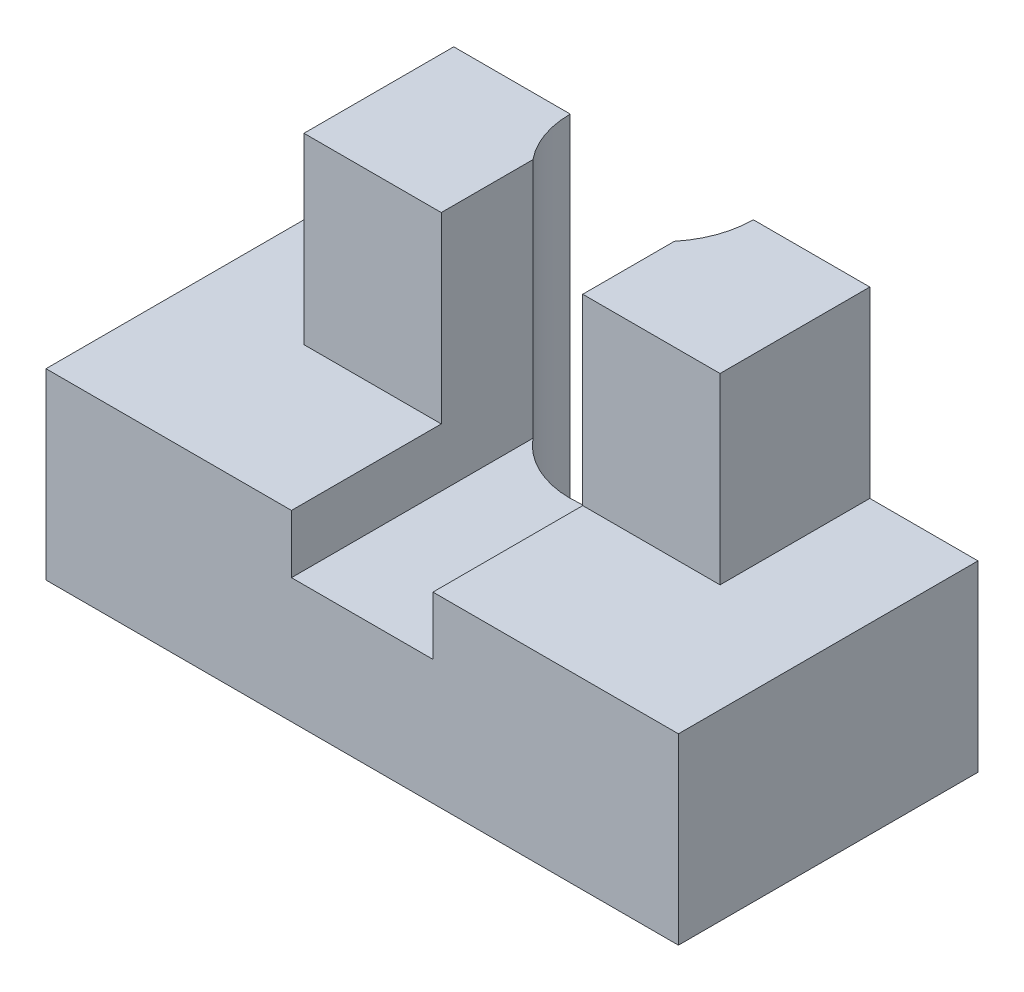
ISO-10303-21;
HEADER;
FILE_DESCRIPTION(('STEP AP214'),'2;1');
FILE_NAME('part.step','',(''),(''),'','','');
FILE_SCHEMA(('AUTOMOTIVE_DESIGN { 1 0 10303 214 1 1 1 1 }'));
ENDSEC;
DATA;
#1=APPLICATION_CONTEXT('core data for automotive mechanical design processes');
#2=APPLICATION_PROTOCOL_DEFINITION('international standard','automotive_design',2000,#1);
#3=PRODUCT_CONTEXT('',#1,'mechanical');
#4=PRODUCT('Part','Part','',(#3));
#5=PRODUCT_RELATED_PRODUCT_CATEGORY('part','',(#4));
#6=PRODUCT_DEFINITION_FORMATION('','',#4);
#7=PRODUCT_DEFINITION_CONTEXT('part definition',#1,'design');
#8=PRODUCT_DEFINITION('design','',#6,#7);
#9=PRODUCT_DEFINITION_SHAPE('','',#8);
#10=(LENGTH_UNIT() NAMED_UNIT(*) SI_UNIT(.MILLI.,.METRE.));
#11=(NAMED_UNIT(*) PLANE_ANGLE_UNIT() SI_UNIT($,.RADIAN.));
#12=(NAMED_UNIT(*) SI_UNIT($,.STERADIAN.) SOLID_ANGLE_UNIT());
#13=UNCERTAINTY_MEASURE_WITH_UNIT(LENGTH_MEASURE(1.E-05),#10,'distance_accuracy_value','');
#14=(GEOMETRIC_REPRESENTATION_CONTEXT(3) GLOBAL_UNCERTAINTY_ASSIGNED_CONTEXT((#13)) GLOBAL_UNIT_ASSIGNED_CONTEXT((#10,
#11,#12)) REPRESENTATION_CONTEXT('',''));
#15=CARTESIAN_POINT('',(0.,0.,0.));
#16=DIRECTION('',(0.,0.,1.));
#17=DIRECTION('',(1.,0.,0.));
#18=AXIS2_PLACEMENT_3D('',#15,#16,#17);
#19=CARTESIAN_POINT('',(-38.,22.,-18.));
#20=DIRECTION('',(0.,0.,1.));
#21=DIRECTION('',(1.,0.,0.));
#22=AXIS2_PLACEMENT_3D('',#19,#20,#21);
#23=PLANE('',#22);
#24=DIRECTION('',(-1.,0.,0.));
#25=VECTOR('',#24,1.);
#26=CARTESIAN_POINT('',(0.,44.,-18.));
#27=LINE('',#26,#25);
#28=CARTESIAN_POINT('',(-11.,44.,-18.));
#29=VERTEX_POINT('',#28);
#30=CARTESIAN_POINT('',(-25.,44.,-18.));
#31=VERTEX_POINT('',#30);
#32=EDGE_CURVE('E223',#29,#31,#27,.T.);
#33=ORIENTED_EDGE('',*,*,#32,.F.);
#34=DIRECTION('',(0.,-1.,0.));
#35=VECTOR('',#34,1.);
#36=CARTESIAN_POINT('',(-11.,0.,-18.));
#37=LINE('',#36,#35);
#38=CARTESIAN_POINT('',(-11.,0.,-18.));
#39=VERTEX_POINT('',#38);
#40=EDGE_CURVE('E222',#29,#39,#37,.T.);
#41=ORIENTED_EDGE('',*,*,#40,.T.);
#42=DIRECTION('',(-1.,0.,0.));
#43=VECTOR('',#42,1.);
#44=CARTESIAN_POINT('',(-38.,0.,-18.));
#45=LINE('',#44,#43);
#46=CARTESIAN_POINT('',(-38.,0.,-18.));
#47=VERTEX_POINT('',#46);
#48=EDGE_CURVE('E161',#39,#47,#45,.T.);
#49=ORIENTED_EDGE('',*,*,#48,.T.);
#50=DIRECTION('',(0.,-1.,0.));
#51=VECTOR('',#50,1.);
#52=CARTESIAN_POINT('',(-38.,22.,-18.));
#53=LINE('',#52,#51);
#54=CARTESIAN_POINT('',(-38.,22.,-18.));
#55=VERTEX_POINT('',#54);
#56=EDGE_CURVE('E177',#55,#47,#53,.T.);
#57=ORIENTED_EDGE('',*,*,#56,.F.);
#58=DIRECTION('',(-1.,0.,0.));
#59=VECTOR('',#58,1.);
#60=CARTESIAN_POINT('',(-38.,22.,-18.));
#61=LINE('',#60,#59);
#62=CARTESIAN_POINT('',(-25.,22.,-18.));
#63=VERTEX_POINT('',#62);
#64=EDGE_CURVE('E191',#63,#55,#61,.T.);
#65=ORIENTED_EDGE('',*,*,#64,.F.);
#66=DIRECTION('',(0.,-1.,0.));
#67=VECTOR('',#66,1.);
#68=CARTESIAN_POINT('',(-25.,44.,-18.));
#69=LINE('',#68,#67);
#70=EDGE_CURVE('E202',#31,#63,#69,.T.);
#71=ORIENTED_EDGE('',*,*,#70,.F.);
#72=EDGE_LOOP('',(#33,#41,#49,#57,#65,#71));
#73=FACE_BOUND('',#72,.T.);
#74=ADVANCED_FACE('F31',(#73),#23,.F.);
#75=CARTESIAN_POINT('',(-38.,22.,18.));
#76=DIRECTION('',(0.,1.,0.));
#77=DIRECTION('',(0.,0.,1.));
#78=AXIS2_PLACEMENT_3D('',#75,#76,#77);
#79=PLANE('',#78);
#80=DIRECTION('',(0.,0.,1.));
#81=VECTOR('',#80,1.);
#82=CARTESIAN_POINT('',(-8.5,22.,18.));
#83=LINE('',#82,#81);
#84=CARTESIAN_POINT('',(-8.5,22.,0.));
#85=VERTEX_POINT('',#84);
#86=CARTESIAN_POINT('',(-8.49999999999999,22.,18.));
#87=VERTEX_POINT('',#86);
#88=EDGE_CURVE('E248',#85,#87,#83,.T.);
#89=ORIENTED_EDGE('',*,*,#88,.F.);
#90=DIRECTION('',(1.,0.,0.));
#91=VECTOR('',#90,1.);
#92=CARTESIAN_POINT('',(0.,22.,0.));
#93=LINE('',#92,#91);
#94=CARTESIAN_POINT('',(-25.,22.,0.));
#95=VERTEX_POINT('',#94);
#96=EDGE_CURVE('E263',#95,#85,#93,.T.);
#97=ORIENTED_EDGE('',*,*,#96,.F.);
#98=DIRECTION('',(0.,0.,1.));
#99=VECTOR('',#98,1.);
#100=CARTESIAN_POINT('',(-25.,22.,-18.));
#101=LINE('',#100,#99);
#102=EDGE_CURVE('E250',#63,#95,#101,.T.);
#103=ORIENTED_EDGE('',*,*,#102,.F.);
#104=ORIENTED_EDGE('',*,*,#64,.T.);
#105=DIRECTION('',(0.,0.,1.));
#106=VECTOR('',#105,1.);
#107=CARTESIAN_POINT('',(-38.,22.,-18.));
#108=LINE('',#107,#106);
#109=CARTESIAN_POINT('',(-38.,22.,18.));
#110=VERTEX_POINT('',#109);
#111=EDGE_CURVE('E168',#55,#110,#108,.T.);
#112=ORIENTED_EDGE('',*,*,#111,.T.);
#113=DIRECTION('',(1.,0.,0.));
#114=VECTOR('',#113,1.);
#115=CARTESIAN_POINT('',(-38.,22.,18.));
#116=LINE('',#115,#114);
#117=EDGE_CURVE('E213',#110,#87,#116,.T.);
#118=ORIENTED_EDGE('',*,*,#117,.T.);
#119=EDGE_LOOP('',(#89,#97,#103,#104,#112,#118));
#120=FACE_BOUND('',#119,.T.);
#121=ADVANCED_FACE('F312',(#120),#79,.T.);
#122=CARTESIAN_POINT('',(0.,44.,0.));
#123=DIRECTION('',(0.,0.,-1.));
#124=DIRECTION('',(-1.,0.,0.));
#125=AXIS2_PLACEMENT_3D('',#122,#123,#124);
#126=PLANE('',#125);
#127=ORIENTED_EDGE('',*,*,#96,.T.);
#128=DIRECTION('',(0.,1.,0.));
#129=VECTOR('',#128,1.);
#130=CARTESIAN_POINT('',(-8.5,44.,0.));
#131=LINE('',#130,#129);
#132=CARTESIAN_POINT('',(-8.5,44.,0.));
#133=VERTEX_POINT('',#132);
#134=EDGE_CURVE('E245',#85,#133,#131,.T.);
#135=ORIENTED_EDGE('',*,*,#134,.T.);
#136=DIRECTION('',(1.,0.,0.));
#137=VECTOR('',#136,1.);
#138=CARTESIAN_POINT('',(0.,44.,0.));
#139=LINE('',#138,#137);
#140=CARTESIAN_POINT('',(-25.,44.,0.));
#141=VERTEX_POINT('',#140);
#142=EDGE_CURVE('E256',#141,#133,#139,.T.);
#143=ORIENTED_EDGE('',*,*,#142,.F.);
#144=DIRECTION('',(0.,-1.,0.));
#145=VECTOR('',#144,1.);
#146=CARTESIAN_POINT('',(-25.,44.,0.));
#147=LINE('',#146,#145);
#148=EDGE_CURVE('E298',#141,#95,#147,.T.);
#149=ORIENTED_EDGE('',*,*,#148,.T.);
#150=EDGE_LOOP('',(#127,#135,#143,#149));
#151=FACE_BOUND('',#150,.T.);
#152=ADVANCED_FACE('F291',(#151),#126,.F.);
#153=CARTESIAN_POINT('',(-25.,44.,-18.));
#154=DIRECTION('',(0.,1.,0.));
#155=DIRECTION('',(0.,0.,1.));
#156=AXIS2_PLACEMENT_3D('',#153,#154,#155);
#157=PLANE('',#156);
#158=CARTESIAN_POINT('',(0.,44.,-18.));
#159=DIRECTION('',(0.,1.,0.));
#160=DIRECTION('',(0.,0.,1.));
#161=AXIS2_PLACEMENT_3D('',#158,#159,#160);
#162=CIRCLE('',#161,11.);
#163=CARTESIAN_POINT('',(-8.49999999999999,44.,-11.0178799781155));
#164=VERTEX_POINT('',#163);
#165=EDGE_CURVE('E226',#29,#164,#162,.T.);
#166=ORIENTED_EDGE('',*,*,#165,.F.);
#167=ORIENTED_EDGE('',*,*,#32,.T.);
#168=DIRECTION('',(0.,0.,1.));
#169=VECTOR('',#168,1.);
#170=CARTESIAN_POINT('',(-25.,44.,-18.));
#171=LINE('',#170,#169);
#172=EDGE_CURVE('E253',#31,#141,#171,.T.);
#173=ORIENTED_EDGE('',*,*,#172,.T.);
#174=ORIENTED_EDGE('',*,*,#142,.T.);
#175=DIRECTION('',(0.,0.,1.));
#176=VECTOR('',#175,1.);
#177=CARTESIAN_POINT('',(-8.5,44.,-18.));
#178=LINE('',#177,#176);
#179=EDGE_CURVE('E39',#164,#133,#178,.T.);
#180=ORIENTED_EDGE('',*,*,#179,.F.);
#181=EDGE_LOOP('',(#166,#167,#173,#174,#180));
#182=FACE_BOUND('',#181,.T.);
#183=ADVANCED_FACE('F293',(#182),#157,.T.);
#184=CARTESIAN_POINT('',(-38.,22.,-18.));
#185=DIRECTION('',(1.,0.,0.));
#186=DIRECTION('',(0.,0.,-1.));
#187=AXIS2_PLACEMENT_3D('',#184,#185,#186);
#188=PLANE('',#187);
#189=DIRECTION('',(0.,0.,1.));
#190=VECTOR('',#189,1.);
#191=CARTESIAN_POINT('',(-38.,0.,-18.));
#192=LINE('',#191,#190);
#193=CARTESIAN_POINT('',(-38.,0.,18.));
#194=VERTEX_POINT('',#193);
#195=EDGE_CURVE('E198',#47,#194,#192,.T.);
#196=ORIENTED_EDGE('',*,*,#195,.T.);
#197=DIRECTION('',(0.,-1.,0.));
#198=VECTOR('',#197,1.);
#199=CARTESIAN_POINT('',(-38.,22.,18.));
#200=LINE('',#199,#198);
#201=EDGE_CURVE('E185',#110,#194,#200,.T.);
#202=ORIENTED_EDGE('',*,*,#201,.F.);
#203=ORIENTED_EDGE('',*,*,#111,.F.);
#204=ORIENTED_EDGE('',*,*,#56,.T.);
#205=EDGE_LOOP('',(#196,#202,#203,#204));
#206=FACE_BOUND('',#205,.T.);
#207=ADVANCED_FACE('F33',(#206),#188,.F.);
#208=CARTESIAN_POINT('',(-38.,22.,18.));
#209=DIRECTION('',(0.,0.,-1.));
#210=DIRECTION('',(-1.,0.,0.));
#211=AXIS2_PLACEMENT_3D('',#208,#209,#210);
#212=PLANE('',#211);
#213=DIRECTION('',(1.,0.,0.));
#214=VECTOR('',#213,1.);
#215=CARTESIAN_POINT('',(-8.49999999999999,15.,18.));
#216=LINE('',#215,#214);
#217=CARTESIAN_POINT('',(-8.49999999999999,15.,18.));
#218=VERTEX_POINT('',#217);
#219=CARTESIAN_POINT('',(8.5,15.,18.));
#220=VERTEX_POINT('',#219);
#221=EDGE_CURVE('E229',#218,#220,#216,.T.);
#222=ORIENTED_EDGE('',*,*,#221,.F.);
#223=DIRECTION('',(0.,-1.,0.));
#224=VECTOR('',#223,1.);
#225=CARTESIAN_POINT('',(-8.5,48.7292686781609,18.));
#226=LINE('',#225,#224);
#227=EDGE_CURVE('E225',#87,#218,#226,.T.);
#228=ORIENTED_EDGE('',*,*,#227,.F.);
#229=ORIENTED_EDGE('',*,*,#117,.F.);
#230=ORIENTED_EDGE('',*,*,#201,.T.);
#231=DIRECTION('',(1.,0.,0.));
#232=VECTOR('',#231,1.);
#233=CARTESIAN_POINT('',(-38.,0.,18.));
#234=LINE('',#233,#232);
#235=CARTESIAN_POINT('',(38.,0.,18.));
#236=VERTEX_POINT('',#235);
#237=EDGE_CURVE('E201',#194,#236,#234,.T.);
#238=ORIENTED_EDGE('',*,*,#237,.T.);
#239=DIRECTION('',(0.,-1.,0.));
#240=VECTOR('',#239,1.);
#241=CARTESIAN_POINT('',(38.,22.,18.));
#242=LINE('',#241,#240);
#243=CARTESIAN_POINT('',(38.,22.,18.));
#244=VERTEX_POINT('',#243);
#245=EDGE_CURVE('E182',#244,#236,#242,.T.);
#246=ORIENTED_EDGE('',*,*,#245,.F.);
#247=CARTESIAN_POINT('',(8.5,22.,18.));
#248=VERTEX_POINT('',#247);
#249=EDGE_CURVE('E171',#248,#244,#116,.T.);
#250=ORIENTED_EDGE('',*,*,#249,.F.);
#251=DIRECTION('',(0.,1.,0.));
#252=VECTOR('',#251,1.);
#253=CARTESIAN_POINT('',(8.5,48.7292686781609,18.));
#254=LINE('',#253,#252);
#255=EDGE_CURVE('E236',#220,#248,#254,.T.);
#256=ORIENTED_EDGE('',*,*,#255,.F.);
#257=EDGE_LOOP('',(#222,#228,#229,#230,#238,#246,#250,#256));
#258=FACE_BOUND('',#257,.T.);
#259=ADVANCED_FACE('F210',(#258),#212,.F.);
#260=CARTESIAN_POINT('',(38.,22.,-18.));
#261=DIRECTION('',(-1.,0.,0.));
#262=DIRECTION('',(0.,0.,1.));
#263=AXIS2_PLACEMENT_3D('',#260,#261,#262);
#264=PLANE('',#263);
#265=DIRECTION('',(0.,0.,-1.));
#266=VECTOR('',#265,1.);
#267=CARTESIAN_POINT('',(38.,0.,-18.));
#268=LINE('',#267,#266);
#269=CARTESIAN_POINT('',(38.,0.,-18.));
#270=VERTEX_POINT('',#269);
#271=EDGE_CURVE('E173',#236,#270,#268,.T.);
#272=ORIENTED_EDGE('',*,*,#271,.T.);
#273=DIRECTION('',(0.,-1.,0.));
#274=VECTOR('',#273,1.);
#275=CARTESIAN_POINT('',(38.,22.,-18.));
#276=LINE('',#275,#274);
#277=CARTESIAN_POINT('',(38.,22.,-18.));
#278=VERTEX_POINT('',#277);
#279=EDGE_CURVE('E167',#278,#270,#276,.T.);
#280=ORIENTED_EDGE('',*,*,#279,.F.);
#281=DIRECTION('',(0.,0.,-1.));
#282=VECTOR('',#281,1.);
#283=CARTESIAN_POINT('',(38.,22.,-18.));
#284=LINE('',#283,#282);
#285=EDGE_CURVE('E196',#244,#278,#284,.T.);
#286=ORIENTED_EDGE('',*,*,#285,.F.);
#287=ORIENTED_EDGE('',*,*,#245,.T.);
#288=EDGE_LOOP('',(#272,#280,#286,#287));
#289=FACE_BOUND('',#288,.T.);
#290=ADVANCED_FACE('F206',(#289),#264,.F.);
#291=CARTESIAN_POINT('',(11.,0.,-18.));
#292=VERTEX_POINT('',#291);
#293=EDGE_CURVE('E159',#270,#292,#45,.T.);
#294=ORIENTED_EDGE('',*,*,#293,.T.);
#295=DIRECTION('',(0.,-1.,0.));
#296=VECTOR('',#295,1.);
#297=CARTESIAN_POINT('',(11.,0.,-18.));
#298=LINE('',#297,#296);
#299=CARTESIAN_POINT('',(11.,44.,-18.));
#300=VERTEX_POINT('',#299);
#301=EDGE_CURVE('E142',#292,#300,#298,.F.);
#302=ORIENTED_EDGE('',*,*,#301,.T.);
#303=CARTESIAN_POINT('',(25.,44.,-18.));
#304=VERTEX_POINT('',#303);
#305=EDGE_CURVE('E251',#304,#300,#27,.T.);
#306=ORIENTED_EDGE('',*,*,#305,.F.);
#307=DIRECTION('',(0.,-1.,0.));
#308=VECTOR('',#307,1.);
#309=CARTESIAN_POINT('',(25.,44.,-18.));
#310=LINE('',#309,#308);
#311=CARTESIAN_POINT('',(25.,22.,-18.));
#312=VERTEX_POINT('',#311);
#313=EDGE_CURVE('E262',#304,#312,#310,.T.);
#314=ORIENTED_EDGE('',*,*,#313,.T.);
#315=EDGE_CURVE('E180',#278,#312,#61,.T.);
#316=ORIENTED_EDGE('',*,*,#315,.F.);
#317=ORIENTED_EDGE('',*,*,#279,.T.);
#318=EDGE_LOOP('',(#294,#302,#306,#314,#316,#317));
#319=FACE_BOUND('',#318,.T.);
#320=ADVANCED_FACE('F164',(#319),#23,.F.);
#321=DIRECTION('',(0.,0.,-1.));
#322=VECTOR('',#321,1.);
#323=CARTESIAN_POINT('',(8.5,22.,18.));
#324=LINE('',#323,#322);
#325=CARTESIAN_POINT('',(8.5,22.,0.));
#326=VERTEX_POINT('',#325);
#327=EDGE_CURVE('E243',#248,#326,#324,.T.);
#328=ORIENTED_EDGE('',*,*,#327,.F.);
#329=ORIENTED_EDGE('',*,*,#249,.T.);
#330=ORIENTED_EDGE('',*,*,#285,.T.);
#331=ORIENTED_EDGE('',*,*,#315,.T.);
#332=DIRECTION('',(0.,0.,-1.));
#333=VECTOR('',#332,1.);
#334=CARTESIAN_POINT('',(25.,22.,-18.));
#335=LINE('',#334,#333);
#336=CARTESIAN_POINT('',(25.,22.,0.));
#337=VERTEX_POINT('',#336);
#338=EDGE_CURVE('E266',#337,#312,#335,.T.);
#339=ORIENTED_EDGE('',*,*,#338,.F.);
#340=EDGE_CURVE('E267',#326,#337,#93,.T.);
#341=ORIENTED_EDGE('',*,*,#340,.F.);
#342=EDGE_LOOP('',(#328,#329,#330,#331,#339,#341));
#343=FACE_BOUND('',#342,.T.);
#344=ADVANCED_FACE('F305',(#343),#79,.T.);
#345=CARTESIAN_POINT('',(-38.,0.,18.));
#346=DIRECTION('',(0.,1.,0.));
#347=DIRECTION('',(0.,0.,1.));
#348=AXIS2_PLACEMENT_3D('',#345,#346,#347);
#349=PLANE('',#348);
#350=ORIENTED_EDGE('',*,*,#48,.F.);
#351=CARTESIAN_POINT('',(0.,0.,-18.));
#352=DIRECTION('',(0.,-1.,0.));
#353=DIRECTION('',(0.,0.,-1.));
#354=AXIS2_PLACEMENT_3D('',#351,#352,#353);
#355=CIRCLE('',#354,11.);
#356=EDGE_CURVE('E145',#292,#39,#355,.T.);
#357=ORIENTED_EDGE('',*,*,#356,.F.);
#358=ORIENTED_EDGE('',*,*,#293,.F.);
#359=ORIENTED_EDGE('',*,*,#271,.F.);
#360=ORIENTED_EDGE('',*,*,#237,.F.);
#361=ORIENTED_EDGE('',*,*,#195,.F.);
#362=EDGE_LOOP('',(#350,#357,#358,#359,#360,#361));
#363=FACE_BOUND('',#362,.T.);
#364=ADVANCED_FACE('F157',(#363),#349,.F.);
#365=CARTESIAN_POINT('',(-25.,44.,-18.));
#366=DIRECTION('',(1.,0.,0.));
#367=DIRECTION('',(0.,0.,-1.));
#368=AXIS2_PLACEMENT_3D('',#365,#366,#367);
#369=PLANE('',#368);
#370=ORIENTED_EDGE('',*,*,#102,.T.);
#371=ORIENTED_EDGE('',*,*,#148,.F.);
#372=ORIENTED_EDGE('',*,*,#172,.F.);
#373=ORIENTED_EDGE('',*,*,#70,.T.);
#374=EDGE_LOOP('',(#370,#371,#372,#373));
#375=FACE_BOUND('',#374,.T.);
#376=ADVANCED_FACE('F299',(#375),#369,.F.);
#377=CARTESIAN_POINT('',(8.5,44.,0.));
#378=VERTEX_POINT('',#377);
#379=CARTESIAN_POINT('',(25.,44.,0.));
#380=VERTEX_POINT('',#379);
#381=EDGE_CURVE('E255',#378,#380,#139,.T.);
#382=ORIENTED_EDGE('',*,*,#381,.F.);
#383=DIRECTION('',(0.,-1.,0.));
#384=VECTOR('',#383,1.);
#385=CARTESIAN_POINT('',(8.5,44.,0.));
#386=LINE('',#385,#384);
#387=EDGE_CURVE('E53',#378,#326,#386,.T.);
#388=ORIENTED_EDGE('',*,*,#387,.T.);
#389=ORIENTED_EDGE('',*,*,#340,.T.);
#390=DIRECTION('',(0.,-1.,0.));
#391=VECTOR('',#390,1.);
#392=CARTESIAN_POINT('',(25.,44.,0.));
#393=LINE('',#392,#391);
#394=EDGE_CURVE('E270',#380,#337,#393,.T.);
#395=ORIENTED_EDGE('',*,*,#394,.F.);
#396=EDGE_LOOP('',(#382,#388,#389,#395));
#397=FACE_BOUND('',#396,.T.);
#398=ADVANCED_FACE('F319',(#397),#126,.F.);
#399=CARTESIAN_POINT('',(25.,44.,-18.));
#400=DIRECTION('',(-1.,0.,0.));
#401=DIRECTION('',(0.,0.,1.));
#402=AXIS2_PLACEMENT_3D('',#399,#400,#401);
#403=PLANE('',#402);
#404=ORIENTED_EDGE('',*,*,#338,.T.);
#405=ORIENTED_EDGE('',*,*,#313,.F.);
#406=DIRECTION('',(0.,0.,-1.));
#407=VECTOR('',#406,1.);
#408=CARTESIAN_POINT('',(25.,44.,-18.));
#409=LINE('',#408,#407);
#410=EDGE_CURVE('E259',#380,#304,#409,.T.);
#411=ORIENTED_EDGE('',*,*,#410,.F.);
#412=ORIENTED_EDGE('',*,*,#394,.T.);
#413=EDGE_LOOP('',(#404,#405,#411,#412));
#414=FACE_BOUND('',#413,.T.);
#415=ADVANCED_FACE('F323',(#414),#403,.F.);
#416=CARTESIAN_POINT('',(0.,44.,-18.));
#417=DIRECTION('',(0.,1.,0.));
#418=DIRECTION('',(0.,0.,1.));
#419=AXIS2_PLACEMENT_3D('',#416,#417,#418);
#420=CIRCLE('',#419,11.);
#421=CARTESIAN_POINT('',(8.5,44.,-11.0178799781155));
#422=VERTEX_POINT('',#421);
#423=EDGE_CURVE('E148',#422,#300,#420,.T.);
#424=ORIENTED_EDGE('',*,*,#423,.F.);
#425=DIRECTION('',(0.,0.,-1.));
#426=VECTOR('',#425,1.);
#427=CARTESIAN_POINT('',(8.5,44.,-18.));
#428=LINE('',#427,#426);
#429=EDGE_CURVE('E188',#378,#422,#428,.T.);
#430=ORIENTED_EDGE('',*,*,#429,.F.);
#431=ORIENTED_EDGE('',*,*,#381,.T.);
#432=ORIENTED_EDGE('',*,*,#410,.T.);
#433=ORIENTED_EDGE('',*,*,#305,.T.);
#434=EDGE_LOOP('',(#424,#430,#431,#432,#433));
#435=FACE_BOUND('',#434,.T.);
#436=ADVANCED_FACE('F325',(#435),#157,.T.);
#437=CARTESIAN_POINT('',(-8.49999999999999,15.,-18.00005));
#438=DIRECTION('',(0.,-1.,0.));
#439=DIRECTION('',(0.,0.,-1.));
#440=AXIS2_PLACEMENT_3D('',#437,#438,#439);
#441=PLANE('',#440);
#442=DIRECTION('',(0.,0.,1.));
#443=VECTOR('',#442,1.);
#444=CARTESIAN_POINT('',(8.5,15.,-18.00005));
#445=LINE('',#444,#443);
#446=CARTESIAN_POINT('',(8.5,15.,-11.0178799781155));
#447=VERTEX_POINT('',#446);
#448=EDGE_CURVE('E239',#447,#220,#445,.T.);
#449=ORIENTED_EDGE('',*,*,#448,.F.);
#450=CARTESIAN_POINT('',(0.,15.,-18.));
#451=DIRECTION('',(0.,-1.,0.));
#452=DIRECTION('',(0.,0.,-1.));
#453=AXIS2_PLACEMENT_3D('',#450,#451,#452);
#454=CIRCLE('',#453,11.);
#455=CARTESIAN_POINT('',(-8.49999999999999,15.,-11.0178799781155));
#456=VERTEX_POINT('',#455);
#457=EDGE_CURVE('E46',#447,#456,#454,.T.);
#458=ORIENTED_EDGE('',*,*,#457,.T.);
#459=DIRECTION('',(0.,0.,1.));
#460=VECTOR('',#459,1.);
#461=CARTESIAN_POINT('',(-8.49999999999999,15.,-18.00005));
#462=LINE('',#461,#460);
#463=EDGE_CURVE('E238',#456,#218,#462,.T.);
#464=ORIENTED_EDGE('',*,*,#463,.T.);
#465=ORIENTED_EDGE('',*,*,#221,.T.);
#466=EDGE_LOOP('',(#449,#458,#464,#465));
#467=FACE_BOUND('',#466,.T.);
#468=ADVANCED_FACE('F311',(#467),#441,.F.);
#469=CARTESIAN_POINT('',(-8.5,48.7292686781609,-18.00005));
#470=DIRECTION('',(-1.,0.,0.));
#471=DIRECTION('',(0.,-1.,0.));
#472=AXIS2_PLACEMENT_3D('',#469,#470,#471);
#473=PLANE('',#472);
#474=ORIENTED_EDGE('',*,*,#463,.F.);
#475=DIRECTION('',(0.,-1.,0.));
#476=VECTOR('',#475,1.);
#477=CARTESIAN_POINT('',(-8.49999999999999,0.,-11.0178799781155));
#478=LINE('',#477,#476);
#479=EDGE_CURVE('E152',#456,#164,#478,.F.);
#480=ORIENTED_EDGE('',*,*,#479,.T.);
#481=ORIENTED_EDGE('',*,*,#179,.T.);
#482=ORIENTED_EDGE('',*,*,#134,.F.);
#483=ORIENTED_EDGE('',*,*,#88,.T.);
#484=ORIENTED_EDGE('',*,*,#227,.T.);
#485=EDGE_LOOP('',(#474,#480,#481,#482,#483,#484));
#486=FACE_BOUND('',#485,.T.);
#487=ADVANCED_FACE('F286',(#486),#473,.F.);
#488=CARTESIAN_POINT('',(8.5,48.7292686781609,-18.00005));
#489=DIRECTION('',(1.,0.,0.));
#490=DIRECTION('',(0.,1.,0.));
#491=AXIS2_PLACEMENT_3D('',#488,#489,#490);
#492=PLANE('',#491);
#493=ORIENTED_EDGE('',*,*,#429,.T.);
#494=DIRECTION('',(0.,-1.,0.));
#495=VECTOR('',#494,1.);
#496=CARTESIAN_POINT('',(8.5,0.,-11.0178799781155));
#497=LINE('',#496,#495);
#498=EDGE_CURVE('E11',#422,#447,#497,.T.);
#499=ORIENTED_EDGE('',*,*,#498,.T.);
#500=ORIENTED_EDGE('',*,*,#448,.T.);
#501=ORIENTED_EDGE('',*,*,#255,.T.);
#502=ORIENTED_EDGE('',*,*,#327,.T.);
#503=ORIENTED_EDGE('',*,*,#387,.F.);
#504=EDGE_LOOP('',(#493,#499,#500,#501,#502,#503));
#505=FACE_BOUND('',#504,.T.);
#506=ADVANCED_FACE('F308',(#505),#492,.F.);
#507=CARTESIAN_POINT('',(0.,0.,-18.));
#508=DIRECTION('',(0.,-1.,0.));
#509=DIRECTION('',(0.,0.,-1.));
#510=AXIS2_PLACEMENT_3D('',#507,#508,#509);
#511=CYLINDRICAL_SURFACE('',#510,11.);
#512=ORIENTED_EDGE('',*,*,#165,.T.);
#513=ORIENTED_EDGE('',*,*,#479,.F.);
#514=ORIENTED_EDGE('',*,*,#457,.F.);
#515=ORIENTED_EDGE('',*,*,#498,.F.);
#516=ORIENTED_EDGE('',*,*,#423,.T.);
#517=ORIENTED_EDGE('',*,*,#301,.F.);
#518=ORIENTED_EDGE('',*,*,#356,.T.);
#519=ORIENTED_EDGE('',*,*,#40,.F.);
#520=EDGE_LOOP('',(#512,#513,#514,#515,#516,#517,#518,#519));
#521=FACE_BOUND('',#520,.T.);
#522=ADVANCED_FACE('F144',(#521),#511,.F.);
#523=CLOSED_SHELL('',(#74,#121,#152,#183,#207,#259,#290,#320,#344,#364,#376,#398,#415,#436,#468,
#487,#506,#522));
#524=MANIFOLD_SOLID_BREP('B2',#523);
#525=ADVANCED_BREP_SHAPE_REPRESENTATION('',(#18,#524),#14);
#526=SHAPE_DEFINITION_REPRESENTATION(#9,#525);
ENDSEC;
END-ISO-10303-21;
